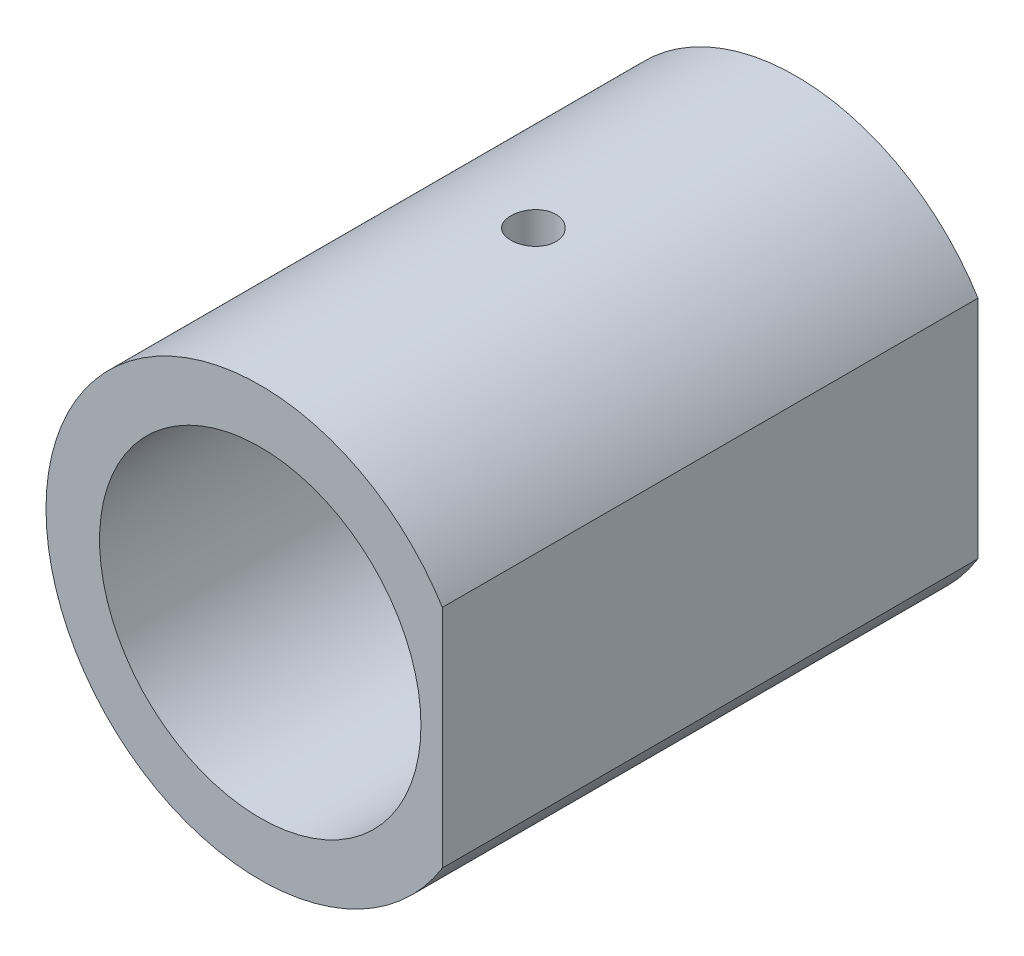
ISO-10303-21;
HEADER;
FILE_DESCRIPTION(('STEP AP214'),'2;1');
FILE_NAME('part.step','',(''),(''),'','','');
FILE_SCHEMA(('AUTOMOTIVE_DESIGN { 1 0 10303 214 1 1 1 1 }'));
ENDSEC;
DATA;
#1=APPLICATION_CONTEXT('core data for automotive mechanical design processes');
#2=APPLICATION_PROTOCOL_DEFINITION('international standard','automotive_design',2000,#1);
#3=PRODUCT_CONTEXT('',#1,'mechanical');
#4=PRODUCT('Part','Part','',(#3));
#5=PRODUCT_RELATED_PRODUCT_CATEGORY('part','',(#4));
#6=PRODUCT_DEFINITION_FORMATION('','',#4);
#7=PRODUCT_DEFINITION_CONTEXT('part definition',#1,'design');
#8=PRODUCT_DEFINITION('design','',#6,#7);
#9=PRODUCT_DEFINITION_SHAPE('','',#8);
#10=(LENGTH_UNIT() NAMED_UNIT(*) SI_UNIT(.MILLI.,.METRE.));
#11=(NAMED_UNIT(*) PLANE_ANGLE_UNIT() SI_UNIT($,.RADIAN.));
#12=(NAMED_UNIT(*) SI_UNIT($,.STERADIAN.) SOLID_ANGLE_UNIT());
#13=UNCERTAINTY_MEASURE_WITH_UNIT(LENGTH_MEASURE(1.E-05),#10,'distance_accuracy_value','');
#14=(GEOMETRIC_REPRESENTATION_CONTEXT(3) GLOBAL_UNCERTAINTY_ASSIGNED_CONTEXT((#13)) GLOBAL_UNIT_ASSIGNED_CONTEXT((#10,
#11,#12)) REPRESENTATION_CONTEXT('',''));
#15=CARTESIAN_POINT('',(0.,0.,0.));
#16=DIRECTION('',(0.,0.,1.));
#17=DIRECTION('',(1.,0.,0.));
#18=AXIS2_PLACEMENT_3D('',#15,#16,#17);
#19=CARTESIAN_POINT('',(0.,0.,25.));
#20=DIRECTION('',(0.,0.,1.));
#21=DIRECTION('',(1.,0.,0.));
#22=AXIS2_PLACEMENT_3D('',#19,#20,#21);
#23=PLANE('',#22);
#24=CARTESIAN_POINT('',(0.,0.,25.));
#25=DIRECTION('',(0.,0.,1.));
#26=DIRECTION('',(1.,0.,0.));
#27=AXIS2_PLACEMENT_3D('',#24,#25,#26);
#28=CIRCLE('',#27,15.);
#29=CARTESIAN_POINT('',(15.,0.,25.));
#30=VERTEX_POINT('',#29);
#31=EDGE_CURVE('E75',#30,#30,#28,.T.);
#32=ORIENTED_EDGE('',*,*,#31,.F.);
#33=EDGE_LOOP('',(#32));
#34=FACE_BOUND('',#33,.T.);
#35=CARTESIAN_POINT('',(0.,0.,25.));
#36=DIRECTION('',(0.,0.,1.));
#37=DIRECTION('',(1.,0.,0.));
#38=AXIS2_PLACEMENT_3D('',#35,#36,#37);
#39=CIRCLE('',#38,20.);
#40=CARTESIAN_POINT('',(17.,10.5356537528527,25.));
#41=VERTEX_POINT('',#40);
#42=CARTESIAN_POINT('',(17.,-10.5356537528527,25.));
#43=VERTEX_POINT('',#42);
#44=EDGE_CURVE('E66',#41,#43,#39,.T.);
#45=ORIENTED_EDGE('',*,*,#44,.T.);
#46=DIRECTION('',(0.,1.,0.));
#47=VECTOR('',#46,1.);
#48=CARTESIAN_POINT('',(17.,10.5356537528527,25.));
#49=LINE('',#48,#47);
#50=EDGE_CURVE('E50',#43,#41,#49,.T.);
#51=ORIENTED_EDGE('',*,*,#50,.T.);
#52=EDGE_LOOP('',(#45,#51));
#53=FACE_BOUND('',#52,.T.);
#54=ADVANCED_FACE('F35',(#34,#53),#23,.T.);
#55=CARTESIAN_POINT('',(0.,0.,-25.));
#56=DIRECTION('',(0.,0.,1.));
#57=DIRECTION('',(1.,0.,0.));
#58=AXIS2_PLACEMENT_3D('',#55,#56,#57);
#59=PLANE('',#58);
#60=CARTESIAN_POINT('',(0.,0.,-25.));
#61=DIRECTION('',(0.,0.,1.));
#62=DIRECTION('',(1.,0.,0.));
#63=AXIS2_PLACEMENT_3D('',#60,#61,#62);
#64=CIRCLE('',#63,15.);
#65=CARTESIAN_POINT('',(15.,0.,-25.));
#66=VERTEX_POINT('',#65);
#67=EDGE_CURVE('E72',#66,#66,#64,.T.);
#68=ORIENTED_EDGE('',*,*,#67,.T.);
#69=EDGE_LOOP('',(#68));
#70=FACE_BOUND('',#69,.T.);
#71=CARTESIAN_POINT('',(0.,0.,-25.));
#72=DIRECTION('',(0.,0.,1.));
#73=DIRECTION('',(1.,0.,0.));
#74=AXIS2_PLACEMENT_3D('',#71,#72,#73);
#75=CIRCLE('',#74,20.);
#76=CARTESIAN_POINT('',(17.,10.5356537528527,-25.));
#77=VERTEX_POINT('',#76);
#78=CARTESIAN_POINT('',(17.,-10.5356537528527,-25.));
#79=VERTEX_POINT('',#78);
#80=EDGE_CURVE('E64',#77,#79,#75,.T.);
#81=ORIENTED_EDGE('',*,*,#80,.F.);
#82=DIRECTION('',(0.,1.,0.));
#83=VECTOR('',#82,1.);
#84=CARTESIAN_POINT('',(17.,10.5356537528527,-25.));
#85=LINE('',#84,#83);
#86=EDGE_CURVE('E61',#79,#77,#85,.T.);
#87=ORIENTED_EDGE('',*,*,#86,.F.);
#88=EDGE_LOOP('',(#81,#87));
#89=FACE_BOUND('',#88,.T.);
#90=ADVANCED_FACE('F62',(#70,#89),#59,.F.);
#91=CARTESIAN_POINT('',(0.,0.,25.));
#92=DIRECTION('',(0.,0.,-1.));
#93=DIRECTION('',(-1.,0.,0.));
#94=AXIS2_PLACEMENT_3D('',#91,#92,#93);
#95=CYLINDRICAL_SURFACE('',#94,20.);
#96=CARTESIAN_POINT('',(-2.11176744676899,19.888198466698,-0.510290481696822));
#97=CARTESIAN_POINT('',(-2.11176236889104,19.8881999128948,-0.627899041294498));
#98=CARTESIAN_POINT('',(-2.10185494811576,19.8892587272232,-0.745584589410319));
#99=CARTESIAN_POINT('',(-2.06248317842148,19.893379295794,-0.977690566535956));
#100=CARTESIAN_POINT('',(-2.03299748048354,19.8964432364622,-1.09210728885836));
#101=CARTESIAN_POINT('',(-1.95533903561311,19.9042247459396,-1.31428089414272));
#102=CARTESIAN_POINT('',(-1.90717786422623,19.9089412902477,-1.42204185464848));
#103=CARTESIAN_POINT('',(-1.79355808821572,19.9194977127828,-1.62792772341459));
#104=CARTESIAN_POINT('',(-1.72810283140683,19.9253373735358,-1.72605449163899));
#105=CARTESIAN_POINT('',(-1.58147199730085,19.9375114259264,-1.91030108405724));
#106=CARTESIAN_POINT('',(-1.50024136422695,19.9438475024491,-1.99637698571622));
#107=CARTESIAN_POINT('',(-1.32448315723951,19.9562894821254,-2.15370001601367));
#108=CARTESIAN_POINT('',(-1.22995496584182,19.9623953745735,-2.22494645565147));
#109=CARTESIAN_POINT('',(-1.03001406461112,19.9737103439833,-2.35074119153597));
#110=CARTESIAN_POINT('',(-0.924576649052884,19.978917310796,-2.40525042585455));
#111=CARTESIAN_POINT('',(-0.705981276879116,19.987834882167,-2.49577348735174));
#112=CARTESIAN_POINT('',(-0.592823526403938,19.9915455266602,-2.53178780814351));
#113=CARTESIAN_POINT('',(-0.362444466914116,19.9970461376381,-2.58416938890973));
#114=CARTESIAN_POINT('',(-0.245239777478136,19.9988431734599,-2.60060898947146));
#115=CARTESIAN_POINT('',(-0.00972181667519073,20.0003442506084,-2.61359837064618));
#116=CARTESIAN_POINT('',(0.108591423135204,20.0000483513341,-2.61014871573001));
#117=CARTESIAN_POINT('',(0.342476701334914,19.9974082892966,-2.58351609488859));
#118=CARTESIAN_POINT('',(0.45805770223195,19.9950721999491,-2.56041091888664));
#119=CARTESIAN_POINT('',(0.683693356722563,19.9886295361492,-2.49524438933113));
#120=CARTESIAN_POINT('',(0.793747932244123,19.9845229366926,-2.45318276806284));
#121=CARTESIAN_POINT('',(1.00545089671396,19.974992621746,-2.35121250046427));
#122=CARTESIAN_POINT('',(1.10708265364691,19.9695663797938,-2.29126956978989));
#123=CARTESIAN_POINT('',(1.29887326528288,19.9580102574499,-2.15526314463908));
#124=CARTESIAN_POINT('',(1.38903174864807,19.9518803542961,-2.07919912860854));
#125=CARTESIAN_POINT('',(1.55577214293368,19.9395739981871,-1.91267254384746));
#126=CARTESIAN_POINT('',(1.63228645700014,19.9333974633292,-1.82214228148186));
#127=CARTESIAN_POINT('',(1.76904252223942,19.9217271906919,-1.62948733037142));
#128=CARTESIAN_POINT('',(1.8292842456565,19.9162334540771,-1.52736262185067));
#129=CARTESIAN_POINT('',(1.93178524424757,19.9065534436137,-1.31436426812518));
#130=CARTESIAN_POINT('',(1.97404011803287,19.9023674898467,-1.20348848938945));
#131=CARTESIAN_POINT('',(2.03931307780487,19.8957856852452,-0.976162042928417));
#132=CARTESIAN_POINT('',(2.06233181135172,19.8933897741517,-0.859711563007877));
#133=CARTESIAN_POINT('',(2.08839152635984,19.8906710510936,-0.625135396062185));
#134=CARTESIAN_POINT('',(2.09152718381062,19.8903384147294,-0.507020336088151));
#135=CARTESIAN_POINT('',(2.07798057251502,19.8917581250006,-0.271946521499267));
#136=CARTESIAN_POINT('',(2.06129859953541,19.8935104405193,-0.154987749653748));
#137=CARTESIAN_POINT('',(2.00866965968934,19.898892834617,0.074176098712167));
#138=CARTESIAN_POINT('',(1.97276765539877,19.9025185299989,0.186391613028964));
#139=CARTESIAN_POINT('',(1.88276393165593,19.911233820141,0.403208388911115));
#140=CARTESIAN_POINT('',(1.82866175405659,19.9163234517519,0.507809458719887));
#141=CARTESIAN_POINT('',(1.70355733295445,19.9274141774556,0.706859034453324));
#142=CARTESIAN_POINT('',(1.63249247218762,19.9334186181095,0.801267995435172));
#143=CARTESIAN_POINT('',(1.47556978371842,19.9456479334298,0.976851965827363));
#144=CARTESIAN_POINT('',(1.38971155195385,19.9518728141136,1.05802661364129));
#145=CARTESIAN_POINT('',(1.20522839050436,19.963867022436,1.20516528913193));
#146=CARTESIAN_POINT('',(1.10655399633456,19.9696344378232,1.27106747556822));
#147=CARTESIAN_POINT('',(0.899483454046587,19.9800315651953,1.38536453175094));
#148=CARTESIAN_POINT('',(0.791087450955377,19.9846612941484,1.4337596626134));
#149=CARTESIAN_POINT('',(0.567864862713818,19.9922476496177,1.5115645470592));
#150=CARTESIAN_POINT('',(0.453051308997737,19.9952075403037,1.54101135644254));
#151=CARTESIAN_POINT('',(0.220077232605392,19.9991282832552,1.58020458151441));
#152=CARTESIAN_POINT('',(0.101916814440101,20.0000891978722,1.58995161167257));
#153=CARTESIAN_POINT('',(-0.133790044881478,19.9998981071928,1.58945944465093));
#154=CARTESIAN_POINT('',(-0.251336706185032,19.9987562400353,1.5793161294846));
#155=CARTESIAN_POINT('',(-0.483044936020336,19.994501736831,1.53953262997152));
#156=CARTESIAN_POINT('',(-0.597206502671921,19.9913890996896,1.50989243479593));
#157=CARTESIAN_POINT('',(-0.818901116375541,19.9835360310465,1.43198379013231));
#158=CARTESIAN_POINT('',(-0.926435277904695,19.9787958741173,1.38371848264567));
#159=CARTESIAN_POINT('',(-1.13189080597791,19.9682101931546,1.26993980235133));
#160=CARTESIAN_POINT('',(-1.22981219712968,19.9623646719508,1.20442647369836));
#161=CARTESIAN_POINT('',(-1.41375404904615,19.9501842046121,1.05765256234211));
#162=CARTESIAN_POINT('',(-1.49971737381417,19.94384711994,0.976320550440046));
#163=CARTESIAN_POINT('',(-1.6568173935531,19.9314119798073,0.80036092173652));
#164=CARTESIAN_POINT('',(-1.72795053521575,19.9253139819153,0.705730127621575));
#165=CARTESIAN_POINT('',(-1.8535301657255,19.9140258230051,0.505568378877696));
#166=CARTESIAN_POINT('',(-1.90792979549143,19.908838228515,0.400007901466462));
#167=CARTESIAN_POINT('',(-1.99815879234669,19.8999858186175,0.18126175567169));
#168=CARTESIAN_POINT('',(-2.03400896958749,19.8963192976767,0.0680847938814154));
#169=CARTESIAN_POINT('',(-2.07724624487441,19.8918407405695,-0.123151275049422));
#170=CARTESIAN_POINT('',(-2.09017384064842,19.8904813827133,-0.199990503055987));
#171=CARTESIAN_POINT('',(-2.1074361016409,19.8886597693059,-0.354638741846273));
#172=CARTESIAN_POINT('',(-2.11177080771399,19.8881975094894,-0.432447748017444));
#173=CARTESIAN_POINT('',(-2.11176744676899,19.888198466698,-0.510290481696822));
#174=B_SPLINE_CURVE_WITH_KNOTS('',3,(#96,#97,#98,#99,#100,#101,#102,#103,#104,#105,#106,#107,
#108,#109,#110,#111,#112,#113,#114,#115,#116,#117,#118,#119,#120,#121,#122,#123,#124,#125,#126,
#127,#128,#129,#130,#131,#132,#133,#134,#135,#136,#137,#138,#139,#140,#141,#142,#143,#144,#145,
#146,#147,#148,#149,#150,#151,#152,#153,#154,#155,#156,#157,#158,#159,#160,#161,#162,#163,#164,
#165,#166,#167,#168,#169,#170,#171,#172,#173),.UNSPECIFIED.,.T.,.F.,(4,2,2,2,2,2,2,2,2,2,2,2,2,
2,2,2,2,2,2,2,2,2,2,2,2,2,2,2,2,2,2,2,2,2,2,2,2,2,4),(0.,0.352541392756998,0.705467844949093,
1.05817589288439,1.41081571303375,1.76470910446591,2.11861893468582,2.47334856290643,
2.82806872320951,3.18147386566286,3.53486897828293,3.88687194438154,4.23887988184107,
4.59156712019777,4.94426577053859,5.29866597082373,5.65306677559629,6.00755425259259,
6.36202979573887,6.71481617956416,7.06759729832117,7.41955671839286,7.77152499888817,
8.12481322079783,8.47811109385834,8.83281547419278,9.18751456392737,9.54151787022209,
9.89551013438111,10.2478001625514,10.6000903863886,10.9523212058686,11.3045511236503,
11.6584100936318,12.0123537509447,12.3672797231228,12.7218066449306,12.9551477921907,
13.188487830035),.UNSPECIFIED.);
#175=CARTESIAN_POINT('',(-2.11176744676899,19.888198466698,-0.510290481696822));
#176=VERTEX_POINT('',#175);
#177=EDGE_CURVE('E103',#176,#176,#174,.T.);
#178=ORIENTED_EDGE('',*,*,#177,.T.);
#179=EDGE_LOOP('',(#178));
#180=FACE_BOUND('',#179,.T.);
#181=ORIENTED_EDGE('',*,*,#80,.T.);
#182=DIRECTION('',(0.,0.,-1.));
#183=VECTOR('',#182,1.);
#184=CARTESIAN_POINT('',(17.,-10.5356537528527,25.));
#185=LINE('',#184,#183);
#186=EDGE_CURVE('E11',#43,#79,#185,.T.);
#187=ORIENTED_EDGE('',*,*,#186,.F.);
#188=ORIENTED_EDGE('',*,*,#44,.F.);
#189=DIRECTION('',(0.,0.,-1.));
#190=VECTOR('',#189,1.);
#191=CARTESIAN_POINT('',(17.,10.5356537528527,25.));
#192=LINE('',#191,#190);
#193=EDGE_CURVE('E44',#41,#77,#192,.T.);
#194=ORIENTED_EDGE('',*,*,#193,.T.);
#195=EDGE_LOOP('',(#181,#187,#188,#194));
#196=FACE_BOUND('',#195,.T.);
#197=ADVANCED_FACE('F37',(#180,#196),#95,.T.);
#198=CARTESIAN_POINT('',(17.,10.5356537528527,25.));
#199=DIRECTION('',(-1.,0.,0.));
#200=DIRECTION('',(0.,0.,1.));
#201=AXIS2_PLACEMENT_3D('',#198,#199,#200);
#202=PLANE('',#201);
#203=ORIENTED_EDGE('',*,*,#86,.T.);
#204=ORIENTED_EDGE('',*,*,#193,.F.);
#205=ORIENTED_EDGE('',*,*,#50,.F.);
#206=ORIENTED_EDGE('',*,*,#186,.T.);
#207=EDGE_LOOP('',(#203,#204,#205,#206));
#208=FACE_BOUND('',#207,.T.);
#209=ADVANCED_FACE('F69',(#208),#202,.F.);
#210=CARTESIAN_POINT('',(0.,0.,-25.));
#211=DIRECTION('',(0.,0.,1.));
#212=DIRECTION('',(1.,0.,0.));
#213=AXIS2_PLACEMENT_3D('',#210,#211,#212);
#214=CYLINDRICAL_SURFACE('',#213,15.);
#215=CARTESIAN_POINT('',(-2.108787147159,14.8510274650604,-0.510290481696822));
#216=CARTESIAN_POINT('',(-2.10878223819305,14.8510293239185,-0.392954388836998));
#217=CARTESIAN_POINT('',(-2.09892064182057,14.8524388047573,-0.275547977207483));
#218=CARTESIAN_POINT('',(-2.05974158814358,14.8579218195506,-0.0440113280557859));
#219=CARTESIAN_POINT('',(-2.03040458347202,14.8619980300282,0.0701154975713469));
#220=CARTESIAN_POINT('',(-1.95316391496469,14.8723454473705,0.291707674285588));
#221=CARTESIAN_POINT('',(-1.90527380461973,14.8786150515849,0.399177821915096));
#222=CARTESIAN_POINT('',(-1.79231679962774,14.8926432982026,0.604538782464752));
#223=CARTESIAN_POINT('',(-1.72725250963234,14.9004017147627,0.702431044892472));
#224=CARTESIAN_POINT('',(-1.58130753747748,14.9165973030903,0.886558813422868));
#225=CARTESIAN_POINT('',(-1.50033058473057,14.9250384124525,0.97271767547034));
#226=CARTESIAN_POINT('',(-1.32506616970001,14.9416174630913,1.13026960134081));
#227=CARTESIAN_POINT('',(-1.23077800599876,14.9497553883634,1.20166188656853));
#228=CARTESIAN_POINT('',(-1.03107985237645,14.964856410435,1.32793382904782));
#229=CARTESIAN_POINT('',(-0.925625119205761,14.9718144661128,1.38274337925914));
#230=CARTESIAN_POINT('',(-0.706893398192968,14.9837339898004,1.47384448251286));
#231=CARTESIAN_POINT('',(-0.593616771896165,14.9886955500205,1.5101368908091));
#232=CARTESIAN_POINT('',(-0.363243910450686,14.9960408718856,1.56294246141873));
#233=CARTESIAN_POINT('',(-0.246177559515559,14.9984413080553,1.57958364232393));
#234=CARTESIAN_POINT('',(-0.0108907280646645,15.0004572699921,1.5930115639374));
#235=CARTESIAN_POINT('',(0.107329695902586,15.0000729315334,1.58979927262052));
#236=CARTESIAN_POINT('',(0.340696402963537,14.9965814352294,1.56371312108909));
#237=CARTESIAN_POINT('',(0.455858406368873,14.9934933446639,1.54097696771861));
#238=CARTESIAN_POINT('',(0.680717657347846,14.9849688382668,1.47670426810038));
#239=CARTESIAN_POINT('',(0.790414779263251,14.979532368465,1.43516728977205));
#240=CARTESIAN_POINT('',(1.00165092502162,14.9668948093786,1.3343287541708));
#241=CARTESIAN_POINT('',(1.10316158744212,14.9596879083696,1.27496854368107));
#242=CARTESIAN_POINT('',(1.29483359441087,14.9443188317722,1.14021131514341));
#243=CARTESIAN_POINT('',(1.38499428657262,14.9361566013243,1.06481337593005));
#244=CARTESIAN_POINT('',(1.552217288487,14.9197103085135,0.899352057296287));
#245=CARTESIAN_POINT('',(1.62916072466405,14.9114258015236,0.809168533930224));
#246=CARTESIAN_POINT('',(1.76683820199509,14.8957409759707,0.61710611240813));
#247=CARTESIAN_POINT('',(1.82757216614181,14.8883406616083,0.515227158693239));
#248=CARTESIAN_POINT('',(1.93111844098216,14.8752653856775,0.302549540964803));
#249=CARTESIAN_POINT('',(1.97391967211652,14.8695914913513,0.191745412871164));
#250=CARTESIAN_POINT('',(2.04027162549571,14.8606333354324,-0.0355751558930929));
#251=CARTESIAN_POINT('',(2.06382352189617,14.857348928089,-0.152091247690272));
#252=CARTESIAN_POINT('',(2.09084740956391,14.8535700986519,-0.3864739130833));
#253=CARTESIAN_POINT('',(2.09448741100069,14.8530523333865,-0.504320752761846));
#254=CARTESIAN_POINT('',(2.08202890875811,14.8548037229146,-0.738942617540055));
#255=CARTESIAN_POINT('',(2.06593093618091,14.8570728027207,-0.855717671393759));
#256=CARTESIAN_POINT('',(2.01459562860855,14.8641200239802,-1.08436788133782));
#257=CARTESIAN_POINT('',(1.9794410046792,14.8688873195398,-1.19626197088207));
#258=CARTESIAN_POINT('',(1.89107619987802,14.8803832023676,-1.41256905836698));
#259=CARTESIAN_POINT('',(1.83786523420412,14.8871118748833,-1.51698173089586));
#260=CARTESIAN_POINT('',(1.71449092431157,14.9018250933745,-1.71611812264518));
#261=CARTESIAN_POINT('',(1.64421822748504,14.9098176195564,-1.81077349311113));
#262=CARTESIAN_POINT('',(1.48886873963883,14.9261299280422,-1.98700795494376));
#263=CARTESIAN_POINT('',(1.40379122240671,14.934449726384,-2.06858640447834));
#264=CARTESIAN_POINT('',(1.22051015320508,14.9505472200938,-2.21694908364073));
#265=CARTESIAN_POINT('',(1.12221636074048,14.9583205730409,-2.28362237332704));
#266=CARTESIAN_POINT('',(0.915727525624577,14.9723791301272,-2.3995114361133));
#267=CARTESIAN_POINT('',(0.807532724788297,14.9786643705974,-2.44872763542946));
#268=CARTESIAN_POINT('',(0.584669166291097,14.9890144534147,-2.52812567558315));
#269=CARTESIAN_POINT('',(0.470022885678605,14.9930865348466,-2.55836962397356));
#270=CARTESIAN_POINT('',(0.237218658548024,14.9985757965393,-2.59916611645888));
#271=CARTESIAN_POINT('',(0.119060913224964,14.9999931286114,-2.60971978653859));
#272=CARTESIAN_POINT('',(-0.116333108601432,15.0000067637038,-2.61081137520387));
#273=CARTESIAN_POINT('',(-0.233568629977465,14.9986270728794,-2.60151958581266));
#274=CARTESIAN_POINT('',(-0.464791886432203,14.9932433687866,-2.56354719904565));
#275=CARTESIAN_POINT('',(-0.578779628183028,14.9892393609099,-2.53486664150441));
#276=CARTESIAN_POINT('',(-0.800235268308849,14.979049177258,-2.45898841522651));
#277=CARTESIAN_POINT('',(-0.907706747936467,14.9728642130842,-2.41180102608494));
#278=CARTESIAN_POINT('',(-1.11323230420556,14.9589884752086,-2.30026647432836));
#279=CARTESIAN_POINT('',(-1.2112861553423,14.9512976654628,-2.2359189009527));
#280=CARTESIAN_POINT('',(-1.39605998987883,14.9351833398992,-2.09126853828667));
#281=CARTESIAN_POINT('',(-1.48268070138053,14.9267543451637,-2.01083954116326));
#282=CARTESIAN_POINT('',(-1.64125967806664,14.9101522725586,-1.83657432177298));
#283=CARTESIAN_POINT('',(-1.71321448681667,14.9019792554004,-1.74273494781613));
#284=CARTESIAN_POINT('',(-1.84072810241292,14.8867684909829,-1.54378105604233));
#285=CARTESIAN_POINT('',(-1.89620554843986,14.8797364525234,-1.43861397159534));
#286=CARTESIAN_POINT('',(-1.98863029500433,14.8676676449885,-1.22040992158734));
#287=CARTESIAN_POINT('',(-2.02559721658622,14.8626287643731,-1.10738143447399));
#288=CARTESIAN_POINT('',(-2.07136677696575,14.8563042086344,-0.913224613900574));
#289=CARTESIAN_POINT('',(-2.08537850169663,14.8543356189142,-0.833306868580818));
#290=CARTESIAN_POINT('',(-2.10409033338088,14.8516966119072,-0.672367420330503));
#291=CARTESIAN_POINT('',(-2.10879053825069,14.8510261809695,-0.591345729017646));
#292=CARTESIAN_POINT('',(-2.108787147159,14.8510274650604,-0.510290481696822));
#293=B_SPLINE_CURVE_WITH_KNOTS('',3,(#215,#216,#217,#218,#219,#220,#221,#222,#223,#224,#225,
#226,#227,#228,#229,#230,#231,#232,#233,#234,#235,#236,#237,#238,#239,#240,#241,#242,#243,#244,
#245,#246,#247,#248,#249,#250,#251,#252,#253,#254,#255,#256,#257,#258,#259,#260,#261,#262,#263,
#264,#265,#266,#267,#268,#269,#270,#271,#272,#273,#274,#275,#276,#277,#278,#279,#280,#281,#282,
#283,#284,#285,#286,#287,#288,#289,#290,#291,#292),.UNSPECIFIED.,.T.,.F.,(4,2,2,2,2,2,2,2,2,2,2,
2,2,2,2,2,2,2,2,2,2,2,2,2,2,2,2,2,2,2,2,2,2,2,2,2,2,2,4),(0.,0.351712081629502,
0.703777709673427,1.05558662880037,1.40734222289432,1.76129534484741,2.11526712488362,
2.47071513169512,2.8261467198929,3.17924983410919,3.53233573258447,3.88295149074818,
4.23357530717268,4.58536585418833,4.93717661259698,5.29200235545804,5.64682978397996,
6.0018761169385,6.35690079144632,6.70892520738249,7.06094015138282,7.41143934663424,
7.76195377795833,8.11477696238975,8.46761745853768,8.82300266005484,9.17837918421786,
9.53258619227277,9.8867729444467,10.2379326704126,10.5890916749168,10.9400559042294,
11.2910285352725,11.6448721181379,11.9987989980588,12.3544454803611,12.7097141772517,
12.9526778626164,13.1956389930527),.UNSPECIFIED.);
#294=CARTESIAN_POINT('',(-2.108787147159,14.8510274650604,-0.510290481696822));
#295=VERTEX_POINT('',#294);
#296=EDGE_CURVE('E105',#295,#295,#293,.T.);
#297=ORIENTED_EDGE('',*,*,#296,.T.);
#298=EDGE_LOOP('',(#297));
#299=FACE_BOUND('',#298,.T.);
#300=ORIENTED_EDGE('',*,*,#31,.T.);
#301=EDGE_LOOP('',(#300));
#302=FACE_BOUND('',#301,.T.);
#303=ORIENTED_EDGE('',*,*,#67,.F.);
#304=EDGE_LOOP('',(#303));
#305=FACE_BOUND('',#304,.T.);
#306=ADVANCED_FACE('F91',(#299,#302,#305),#214,.F.);
#307=CARTESIAN_POINT('',(-0.011833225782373,19.9999964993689,-0.510290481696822));
#308=DIRECTION('',(-0.000591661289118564,0.999999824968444,0.));
#309=DIRECTION('',(-0.999999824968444,-0.000591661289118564,0.));
#310=AXIS2_PLACEMENT_3D('',#307,#308,#309);
#311=CYLINDRICAL_SURFACE('',#310,2.09999999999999);
#312=ORIENTED_EDGE('',*,*,#296,.F.);
#313=EDGE_LOOP('',(#312));
#314=FACE_BOUND('',#313,.T.);
#315=ORIENTED_EDGE('',*,*,#177,.F.);
#316=EDGE_LOOP('',(#315));
#317=FACE_BOUND('',#316,.T.);
#318=ADVANCED_FACE('F96',(#314,#317),#311,.F.);
#319=CLOSED_SHELL('',(#54,#90,#197,#209,#306,#318));
#320=MANIFOLD_SOLID_BREP('B2',#319);
#321=ADVANCED_BREP_SHAPE_REPRESENTATION('',(#18,#320),#14);
#322=SHAPE_DEFINITION_REPRESENTATION(#9,#321);
ENDSEC;
END-ISO-10303-21;
